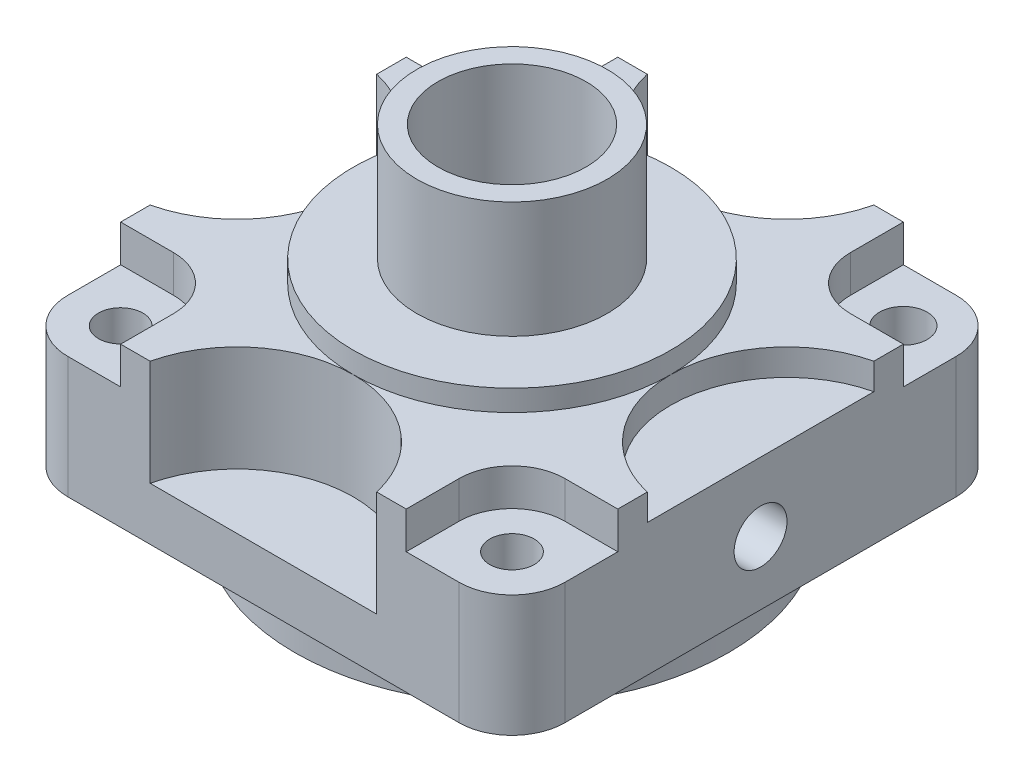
from build123d import *

# Parameters (mm, degrees)
ESQUISSE1_W                     = 47
ESQUISSE1_H                     = 15
EXTRUSION1_DEPTH                = 47
ESQUISSE2_R                     = 20.5
EXTRUSION2_DEPTH                = 5
ESQUISSE3_R                     = 9.75
EXTRUSION3_DEPTH                = 3.5
ESQUISSE4_R                     = 15
EXTRUSION4_DEPTH                = 2
ESQUISSE5_R                     = 9
EXTRUSION5_DEPTH                = 11
ESQUISSE6_R                     = 7
ENL_V_MAT_EXTRU_1_DEPTH         = 13
ESQUISSE7_R                     = 5.75
ENL_V_MAT_EXTRU_2_DEPTH         = 58.563008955
ESQUISSE8_R                     = 8.25
ENL_V_MAT_EXTRU_3_DEPTH         = 17
ENL_V_MAT_EXTRU_4_DEPTH         = 10
TROU_TARAUD_M63_D               = 5
TROU_TARAUD_M63_DEPTH           = 12
TROU_TARAUD_M63_TIP             = 1.502151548
TROU_TARAUD_M63_ON_FACE_2_D     = 5
TROU_TARAUD_M63_ON_FACE_2_DEPTH = 12
TROU_TARAUD_M63_ON_FACE_2_TIP   = 1.502151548
ENL_V_MAT_EXTRU_5_DEPTH         = 2.5
ESQUISSE12_R                    = 2.25
ESQUISSE12_R_2                  = 2.1
ENL_V_MAT_EXTRU_6_DEPTH         = 58.563008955
CONG_1_R                        = 5
EXTRUSION11_DEPTH               = 3.5
ESQUISSE14_R                    = 2
ENL_V_MAT_EXTRU_7_DEPTH         = 10


with BuildPart() as part:
    # Esquisse1 → Extrusion1 (new body)
    with BuildSketch(Plane.XY):
        with Locations((0, 7.5)):
            Rectangle(ESQUISSE1_W, ESQUISSE1_H)
    extrude(amount=EXTRUSION1_DEPTH)

    # Esquisse2 → Extrusion2 (add)
    with BuildSketch(Plane.XZ):
        with Locations(Location((0, 23.528493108, 0), (0, 0, 90))):
            Circle(ESQUISSE2_R)
    extrude(amount=EXTRUSION2_DEPTH)

    # Esquisse3 → Extrusion3 (add)
    with BuildSketch(Plane.XZ.offset(5)):
        with Locations((0, 23.528493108)):
            Circle(ESQUISSE3_R)
    extrude(amount=EXTRUSION3_DEPTH)

    # Esquisse4 → Extrusion4 (add)
    with BuildSketch(Plane(origin=(0, 15, 0), x_dir=(-1, 0, 0), z_dir=(0, 1, 0))):
        with Locations(Location((0, 23.5, 0), (0, 0, 270))):
            Circle(ESQUISSE4_R)
    extrude(amount=EXTRUSION4_DEPTH)

    # Esquisse5 → Extrusion5 (add)
    with BuildSketch(Plane(origin=(0, 17, 0), x_dir=(-1, 0, 0), z_dir=(0, 1, 0))):
        with Locations(Location((0, 23.5, 0), (0, 0, 90))):
            Circle(ESQUISSE5_R)
    extrude(amount=EXTRUSION5_DEPTH)

    # Esquisse6 → Enl_v. mat.-Extru.1 (cut)
    with BuildSketch(Plane(origin=(0, 28, 0), x_dir=(-1, 0, 0), z_dir=(0, 1, 0))):
        with Locations(Location((0, 23.5, 0), (0, 0, 90))):
            Circle(ESQUISSE6_R)
    extrude(amount=-ENL_V_MAT_EXTRU_1_DEPTH, mode=Mode.SUBTRACT)

    # Esquisse7 → Enl_v. mat.-Extru.2 (cut, through all)
    with BuildSketch(Plane(origin=(0, 15, 0), x_dir=(-1, 0, 0), z_dir=(0, 1, 0))):
        with Locations(Location((0, 23.5, 0), (0, 0, 90))):
            Circle(ESQUISSE7_R)
    extrude(amount=-ENL_V_MAT_EXTRU_2_DEPTH, mode=Mode.SUBTRACT)

    # Esquisse8 → Enl_v. mat.-Extru.3 (cut)
    with BuildSketch(Plane.XZ.offset(8.5)):
        with Locations((0, 23.528493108)):
            Circle(ESQUISSE8_R)
    extrude(amount=-ENL_V_MAT_EXTRU_3_DEPTH, mode=Mode.SUBTRACT)

    # Esquisse9 → Enl_v. mat.-Extru.4 (cut)
    with BuildSketch(Plane(origin=(0, 15, 0), x_dir=(-1, 0, 0), z_dir=(0, 1, 0))):
        with BuildLine():
            Line((-10.712142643, 0), (10.712142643, 0))
            ThreePointArc((10.712142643, 0), (0, 8.5), (-10.712142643, 0))
        make_face()
        with BuildLine():
            Line((-10.712142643, 47), (10.712142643, 47))
            ThreePointArc((10.712142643, 47), (0, 38.5), (-10.712142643, 47))
        make_face()
        with BuildLine():
            Line((23.5, 12.787857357), (23.5, 34.212142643))
            ThreePointArc((23.5, 34.212142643), (15, 23.5), (23.5, 12.787857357))
        make_face()
    extrude(amount=-ENL_V_MAT_EXTRU_4_DEPTH, mode=Mode.SUBTRACT)

    # Trou taraud_ M63
    with Locations(Plane(origin=(23.5, 6, 23.5), x_dir=(0, 1, 0), z_dir=(1, 0, 0))):
        with Locations((0, 0)):
            Hole(TROU_TARAUD_M63_D / 2, depth=TROU_TARAUD_M63_DEPTH)
            with Locations((0, 0, -(TROU_TARAUD_M63_DEPTH + TROU_TARAUD_M63_TIP / 2))):  # 118° drill point
                Cone(0, TROU_TARAUD_M63_D / 2, TROU_TARAUD_M63_TIP, mode=Mode.SUBTRACT)

    # Trou taraud_ M63 on face 2
    with Locations(Plane(origin=(0, -12.364018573, -29.415216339), x_dir=(0, 1, 0), z_dir=(1, 0, 0))):
        with Locations((0, 0)):
            Hole(TROU_TARAUD_M63_ON_FACE_2_D / 2, depth=TROU_TARAUD_M63_ON_FACE_2_DEPTH)
            with Locations((0, 0, -(TROU_TARAUD_M63_ON_FACE_2_DEPTH + TROU_TARAUD_M63_ON_FACE_2_TIP / 2))):  # 118° drill point
                Cone(0, TROU_TARAUD_M63_ON_FACE_2_D / 2, TROU_TARAUD_M63_ON_FACE_2_TIP, mode=Mode.SUBTRACT)

    # Esquisse10 → Enl_v. mat.-Extru.5 (cut)
    with BuildSketch(Plane(origin=(0, 15, 0), x_dir=(-1, 0, 0), z_dir=(0, 1, 0))):
        with BuildLine():
            Line((-23.5, 12.787857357), (-23.5, 34.212142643))
            ThreePointArc((-23.5, 34.212142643), (-15, 23.5), (-23.5, 12.787857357))
        make_face()
    extrude(amount=-ENL_V_MAT_EXTRU_5_DEPTH, mode=Mode.SUBTRACT)

    # Esquisse12 → Enl_v. mat.-Extru.6 (cut, through all)
    with BuildSketch(Plane(origin=(0, 15, 0), x_dir=(-1, 0, 0), z_dir=(0, 1, 0))):
        with Locations(Location((-18.5, 5, 0), (0, 0, 90))):
            Circle(ESQUISSE12_R)
        with Locations(Location((-18.5, 42, 0), (0, 0, 90))):
            Circle(ESQUISSE12_R_2)
        with Locations(Location((18.5, 42, 0), (0, 0, 90))):
            Circle(ESQUISSE12_R_2)
        with Locations(Location((18.5, 5, 0), (0, 0, 90))):
            Circle(ESQUISSE12_R_2)
    extrude(amount=-ENL_V_MAT_EXTRU_6_DEPTH, mode=Mode.SUBTRACT)

    # Cong_1
    cong_1_edges = [part.edges().sort_by_distance(p)[0] for p in [
        (23.5, 7.5, 47),
        (-23.5, 7.5, 47),
        (23.5, 7.5, 0),
        (-23.5, 7.5, 0),
    ]]
    fillet(cong_1_edges, radius=CONG_1_R)

    # Esquisse13 → Extrusion11 (cut)
    with BuildSketch(Plane(origin=(0, 15, 0), x_dir=(1, 0, 0), z_dir=(0, 1, 0))):
        with BuildLine():
            Line((13.5, -42), (13.5, -47))
            Line((13.5, -47), (18.5, -47))
            ThreePointArc((18.5, -47), (22.035533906, -45.535533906), (23.5, -42))
            Line((23.5, -42), (23.5, -37))
            Line((23.5, -37), (18.5, -37))
            ThreePointArc((18.5, -37), (14.964466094, -38.464466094), (13.5, -42))
        make_face()
        with BuildLine():
            Line((18.5, -10), (23.5, -10))
            Line((23.5, -10), (23.5, -5))
            ThreePointArc((23.5, -5), (22.035533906, -1.464466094), (18.5, 0))
            Line((18.5, 0), (13.5, 0))
            Line((13.5, 0), (13.5, -5))
            ThreePointArc((13.5, -5), (14.964466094, -8.535533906), (18.5, -10))
        make_face()
        with BuildLine():
            Line((-13.5, -5), (-13.5, 0))
            Line((-13.5, 0), (-18.5, 0))
            ThreePointArc((-18.5, 0), (-22.035533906, -1.464466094), (-23.5, -5))
            Line((-23.5, -5), (-23.5, -10))
            Line((-23.5, -10), (-18.5, -10))
            ThreePointArc((-18.5, -10), (-14.964466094, -8.535533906), (-13.5, -5))
        make_face()
        with BuildLine():
            Line((-13.5, -42), (-13.5, -47))
            Line((-13.5, -47), (-18.5, -47))
            ThreePointArc((-18.5, -47), (-22.035533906, -45.535533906), (-23.5, -42))
            Line((-23.5, -42), (-23.5, -37))
            Line((-23.5, -37), (-18.5, -37))
            ThreePointArc((-18.5, -37), (-14.964466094, -38.464466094), (-13.5, -42))
        make_face()
    extrude(amount=-EXTRUSION11_DEPTH, mode=Mode.SUBTRACT)

    # Esquisse14 → Enl_v. mat.-Extru.7 (cut)
    with BuildSketch(Plane.XZ.offset(5)):
        with Locations((16, 23.5)):
            Circle(ESQUISSE14_R)
    extrude(amount=-ENL_V_MAT_EXTRU_7_DEPTH, mode=Mode.SUBTRACT)


solid = part.part
